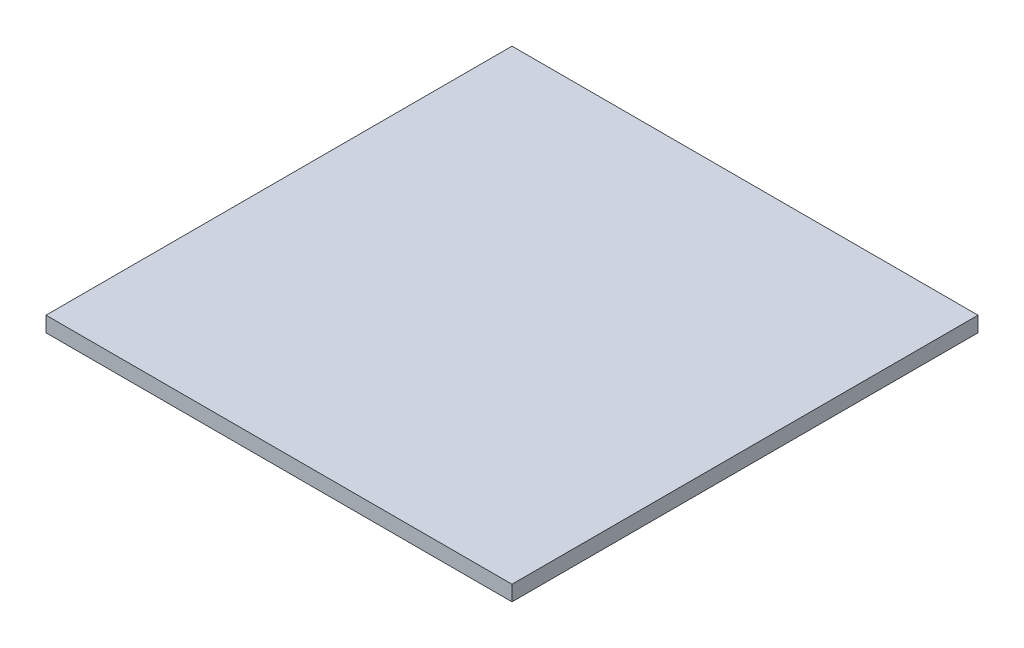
from build123d import *

# Parameters (mm, degrees)
SKETCH1_W           = 38.1
SKETCH1_H           = 38.1
BOSS_EXTRUDE1_DEPTH = 1.25


with BuildPart() as part:
    # Sketch1 → Boss-Extrude1 (new body)
    with BuildSketch(Plane(origin=(0, 0, 0), x_dir=(1, 0, 0), z_dir=(0, 1, 0))):
        Rectangle(SKETCH1_W, SKETCH1_H)
    extrude(amount=BOSS_EXTRUDE1_DEPTH)


solid = part.part
